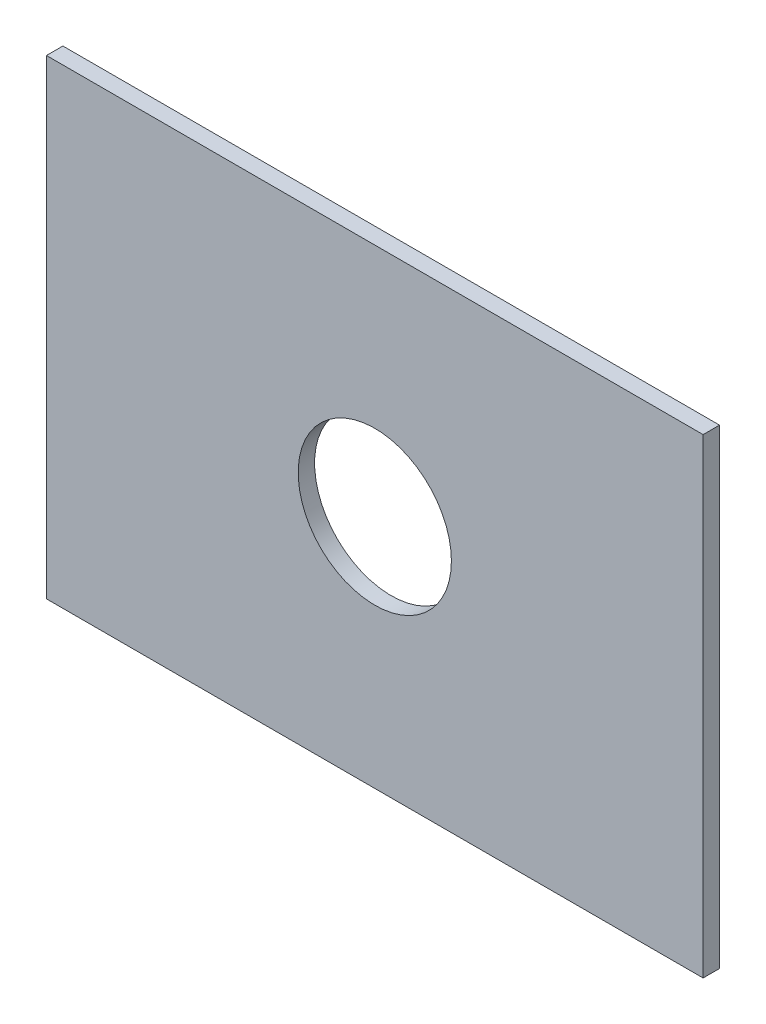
ISO-10303-21;
HEADER;
FILE_DESCRIPTION(('STEP AP214'),'2;1');
FILE_NAME('part.step','',(''),(''),'','','');
FILE_SCHEMA(('AUTOMOTIVE_DESIGN { 1 0 10303 214 1 1 1 1 }'));
ENDSEC;
DATA;
#1=APPLICATION_CONTEXT('core data for automotive mechanical design processes');
#2=APPLICATION_PROTOCOL_DEFINITION('international standard','automotive_design',2000,#1);
#3=PRODUCT_CONTEXT('',#1,'mechanical');
#4=PRODUCT('Part','Part','',(#3));
#5=PRODUCT_RELATED_PRODUCT_CATEGORY('part','',(#4));
#6=PRODUCT_DEFINITION_FORMATION('','',#4);
#7=PRODUCT_DEFINITION_CONTEXT('part definition',#1,'design');
#8=PRODUCT_DEFINITION('design','',#6,#7);
#9=PRODUCT_DEFINITION_SHAPE('','',#8);
#10=(LENGTH_UNIT() NAMED_UNIT(*) SI_UNIT(.MILLI.,.METRE.));
#11=(NAMED_UNIT(*) PLANE_ANGLE_UNIT() SI_UNIT($,.RADIAN.));
#12=(NAMED_UNIT(*) SI_UNIT($,.STERADIAN.) SOLID_ANGLE_UNIT());
#13=UNCERTAINTY_MEASURE_WITH_UNIT(LENGTH_MEASURE(1.E-05),#10,'distance_accuracy_value','');
#14=(GEOMETRIC_REPRESENTATION_CONTEXT(3) GLOBAL_UNCERTAINTY_ASSIGNED_CONTEXT((#13)) GLOBAL_UNIT_ASSIGNED_CONTEXT((#10,
#11,#12)) REPRESENTATION_CONTEXT('',''));
#15=CARTESIAN_POINT('',(0.,0.,0.));
#16=DIRECTION('',(0.,0.,1.));
#17=DIRECTION('',(1.,0.,0.));
#18=AXIS2_PLACEMENT_3D('',#15,#16,#17);
#19=CARTESIAN_POINT('',(300.,215.,15.));
#20=DIRECTION('',(-1.,0.,0.));
#21=DIRECTION('',(0.,-1.,0.));
#22=AXIS2_PLACEMENT_3D('',#19,#20,#21);
#23=PLANE('',#22);
#24=DIRECTION('',(0.,1.,0.));
#25=VECTOR('',#24,1.);
#26=CARTESIAN_POINT('',(300.,215.,0.));
#27=LINE('',#26,#25);
#28=CARTESIAN_POINT('',(300.,-215.,0.));
#29=VERTEX_POINT('',#28);
#30=CARTESIAN_POINT('',(300.,215.,0.));
#31=VERTEX_POINT('',#30);
#32=EDGE_CURVE('E105',#29,#31,#27,.T.);
#33=ORIENTED_EDGE('',*,*,#32,.T.);
#34=DIRECTION('',(0.,0.,-1.));
#35=VECTOR('',#34,1.);
#36=CARTESIAN_POINT('',(300.,215.,15.));
#37=LINE('',#36,#35);
#38=CARTESIAN_POINT('',(300.,215.,15.));
#39=VERTEX_POINT('',#38);
#40=EDGE_CURVE('E11',#39,#31,#37,.T.);
#41=ORIENTED_EDGE('',*,*,#40,.F.);
#42=DIRECTION('',(0.,1.,0.));
#43=VECTOR('',#42,1.);
#44=CARTESIAN_POINT('',(300.,215.,15.));
#45=LINE('',#44,#43);
#46=CARTESIAN_POINT('',(300.,-215.,15.));
#47=VERTEX_POINT('',#46);
#48=EDGE_CURVE('E93',#47,#39,#45,.T.);
#49=ORIENTED_EDGE('',*,*,#48,.F.);
#50=DIRECTION('',(0.,0.,-1.));
#51=VECTOR('',#50,1.);
#52=CARTESIAN_POINT('',(300.,-215.,15.));
#53=LINE('',#52,#51);
#54=EDGE_CURVE('E101',#47,#29,#53,.T.);
#55=ORIENTED_EDGE('',*,*,#54,.T.);
#56=EDGE_LOOP('',(#33,#41,#49,#55));
#57=FACE_BOUND('',#56,.T.);
#58=ADVANCED_FACE('F42',(#57),#23,.F.);
#59=CARTESIAN_POINT('',(-300.,215.,15.));
#60=DIRECTION('',(0.,-1.,0.));
#61=DIRECTION('',(0.,0.,-1.));
#62=AXIS2_PLACEMENT_3D('',#59,#60,#61);
#63=PLANE('',#62);
#64=DIRECTION('',(-1.,0.,0.));
#65=VECTOR('',#64,1.);
#66=CARTESIAN_POINT('',(-300.,215.,0.));
#67=LINE('',#66,#65);
#68=CARTESIAN_POINT('',(-300.,215.,0.));
#69=VERTEX_POINT('',#68);
#70=EDGE_CURVE('E97',#31,#69,#67,.T.);
#71=ORIENTED_EDGE('',*,*,#70,.T.);
#72=DIRECTION('',(0.,0.,-1.));
#73=VECTOR('',#72,1.);
#74=CARTESIAN_POINT('',(-300.,215.,15.));
#75=LINE('',#74,#73);
#76=CARTESIAN_POINT('',(-300.,215.,15.));
#77=VERTEX_POINT('',#76);
#78=EDGE_CURVE('E50',#77,#69,#75,.T.);
#79=ORIENTED_EDGE('',*,*,#78,.F.);
#80=DIRECTION('',(-1.,0.,0.));
#81=VECTOR('',#80,1.);
#82=CARTESIAN_POINT('',(-300.,215.,15.));
#83=LINE('',#82,#81);
#84=EDGE_CURVE('E88',#39,#77,#83,.T.);
#85=ORIENTED_EDGE('',*,*,#84,.F.);
#86=ORIENTED_EDGE('',*,*,#40,.T.);
#87=EDGE_LOOP('',(#71,#79,#85,#86));
#88=FACE_BOUND('',#87,.T.);
#89=ADVANCED_FACE('F96',(#88),#63,.F.);
#90=CARTESIAN_POINT('',(-300.,215.,15.));
#91=DIRECTION('',(1.,0.,0.));
#92=DIRECTION('',(0.,1.,0.));
#93=AXIS2_PLACEMENT_3D('',#90,#91,#92);
#94=PLANE('',#93);
#95=DIRECTION('',(0.,-1.,0.));
#96=VECTOR('',#95,1.);
#97=CARTESIAN_POINT('',(-300.,215.,0.));
#98=LINE('',#97,#96);
#99=CARTESIAN_POINT('',(-300.,-215.,0.));
#100=VERTEX_POINT('',#99);
#101=EDGE_CURVE('E75',#69,#100,#98,.T.);
#102=ORIENTED_EDGE('',*,*,#101,.T.);
#103=DIRECTION('',(0.,0.,-1.));
#104=VECTOR('',#103,1.);
#105=CARTESIAN_POINT('',(-300.,-215.,15.));
#106=LINE('',#105,#104);
#107=CARTESIAN_POINT('',(-300.,-215.,15.));
#108=VERTEX_POINT('',#107);
#109=EDGE_CURVE('E98',#108,#100,#106,.T.);
#110=ORIENTED_EDGE('',*,*,#109,.F.);
#111=DIRECTION('',(0.,-1.,0.));
#112=VECTOR('',#111,1.);
#113=CARTESIAN_POINT('',(-300.,215.,15.));
#114=LINE('',#113,#112);
#115=EDGE_CURVE('E91',#77,#108,#114,.T.);
#116=ORIENTED_EDGE('',*,*,#115,.F.);
#117=ORIENTED_EDGE('',*,*,#78,.T.);
#118=EDGE_LOOP('',(#102,#110,#116,#117));
#119=FACE_BOUND('',#118,.T.);
#120=ADVANCED_FACE('F99',(#119),#94,.F.);
#121=CARTESIAN_POINT('',(-300.,-215.,15.));
#122=DIRECTION('',(0.,1.,0.));
#123=DIRECTION('',(0.,0.,1.));
#124=AXIS2_PLACEMENT_3D('',#121,#122,#123);
#125=PLANE('',#124);
#126=DIRECTION('',(1.,0.,0.));
#127=VECTOR('',#126,1.);
#128=CARTESIAN_POINT('',(-300.,-215.,0.));
#129=LINE('',#128,#127);
#130=EDGE_CURVE('E81',#100,#29,#129,.T.);
#131=ORIENTED_EDGE('',*,*,#130,.T.);
#132=ORIENTED_EDGE('',*,*,#54,.F.);
#133=DIRECTION('',(1.,0.,0.));
#134=VECTOR('',#133,1.);
#135=CARTESIAN_POINT('',(-300.,-215.,15.));
#136=LINE('',#135,#134);
#137=EDGE_CURVE('E58',#108,#47,#136,.T.);
#138=ORIENTED_EDGE('',*,*,#137,.F.);
#139=ORIENTED_EDGE('',*,*,#109,.T.);
#140=EDGE_LOOP('',(#131,#132,#138,#139));
#141=FACE_BOUND('',#140,.T.);
#142=ADVANCED_FACE('F113',(#141),#125,.F.);
#143=CARTESIAN_POINT('',(0.,0.,15.));
#144=DIRECTION('',(0.,0.,1.));
#145=DIRECTION('',(1.,0.,0.));
#146=AXIS2_PLACEMENT_3D('',#143,#144,#145);
#147=PLANE('',#146);
#148=CARTESIAN_POINT('',(0.,0.,15.));
#149=DIRECTION('',(0.,0.,1.));
#150=DIRECTION('',(1.,0.,0.));
#151=AXIS2_PLACEMENT_3D('',#148,#149,#150);
#152=CIRCLE('',#151,70.);
#153=CARTESIAN_POINT('',(70.,0.,15.));
#154=VERTEX_POINT('',#153);
#155=EDGE_CURVE('E119',#154,#154,#152,.T.);
#156=ORIENTED_EDGE('',*,*,#155,.F.);
#157=EDGE_LOOP('',(#156));
#158=FACE_BOUND('',#157,.T.);
#159=ORIENTED_EDGE('',*,*,#48,.T.);
#160=ORIENTED_EDGE('',*,*,#84,.T.);
#161=ORIENTED_EDGE('',*,*,#115,.T.);
#162=ORIENTED_EDGE('',*,*,#137,.T.);
#163=EDGE_LOOP('',(#159,#160,#161,#162));
#164=FACE_BOUND('',#163,.T.);
#165=ADVANCED_FACE('F89',(#158,#164),#147,.T.);
#166=CARTESIAN_POINT('',(0.,0.,0.));
#167=DIRECTION('',(0.,0.,1.));
#168=DIRECTION('',(1.,0.,0.));
#169=AXIS2_PLACEMENT_3D('',#166,#167,#168);
#170=PLANE('',#169);
#171=CARTESIAN_POINT('',(0.,0.,0.));
#172=DIRECTION('',(0.,0.,1.));
#173=DIRECTION('',(1.,0.,0.));
#174=AXIS2_PLACEMENT_3D('',#171,#172,#173);
#175=CIRCLE('',#174,70.);
#176=CARTESIAN_POINT('',(70.,0.,0.));
#177=VERTEX_POINT('',#176);
#178=EDGE_CURVE('E108',#177,#177,#175,.T.);
#179=ORIENTED_EDGE('',*,*,#178,.T.);
#180=EDGE_LOOP('',(#179));
#181=FACE_BOUND('',#180,.T.);
#182=ORIENTED_EDGE('',*,*,#32,.F.);
#183=ORIENTED_EDGE('',*,*,#130,.F.);
#184=ORIENTED_EDGE('',*,*,#101,.F.);
#185=ORIENTED_EDGE('',*,*,#70,.F.);
#186=EDGE_LOOP('',(#182,#183,#184,#185));
#187=FACE_BOUND('',#186,.T.);
#188=ADVANCED_FACE('F116',(#181,#187),#170,.F.);
#189=CARTESIAN_POINT('',(0.,0.,0.));
#190=DIRECTION('',(0.,0.,1.));
#191=DIRECTION('',(1.,0.,0.));
#192=AXIS2_PLACEMENT_3D('',#189,#190,#191);
#193=CYLINDRICAL_SURFACE('',#192,70.);
#194=ORIENTED_EDGE('',*,*,#178,.F.);
#195=EDGE_LOOP('',(#194));
#196=FACE_BOUND('',#195,.T.);
#197=ORIENTED_EDGE('',*,*,#155,.T.);
#198=EDGE_LOOP('',(#197));
#199=FACE_BOUND('',#198,.T.);
#200=ADVANCED_FACE('F126',(#196,#199),#193,.F.);
#201=CLOSED_SHELL('',(#58,#89,#120,#142,#165,#188,#200));
#202=MANIFOLD_SOLID_BREP('B2',#201);
#203=ADVANCED_BREP_SHAPE_REPRESENTATION('',(#18,#202),#14);
#204=SHAPE_DEFINITION_REPRESENTATION(#9,#203);
ENDSEC;
END-ISO-10303-21;
